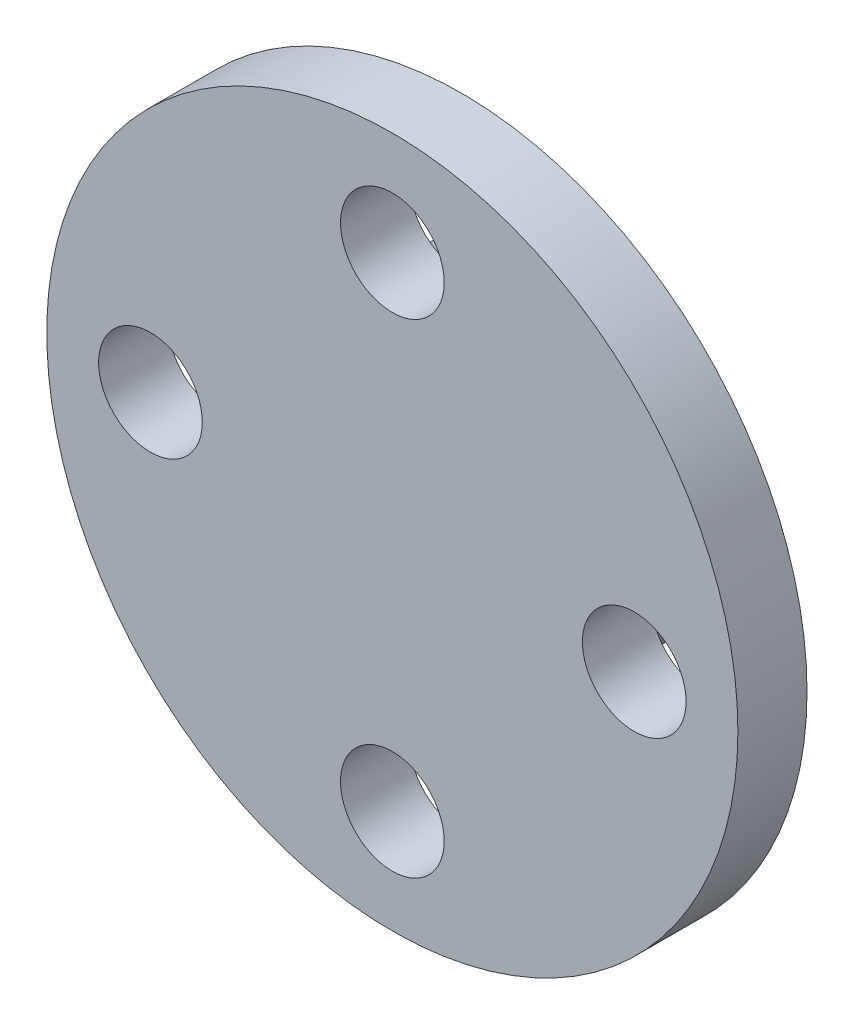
ISO-10303-21;
HEADER;
FILE_DESCRIPTION(('STEP AP214'),'2;1');
FILE_NAME('part.step','',(''),(''),'','','');
FILE_SCHEMA(('AUTOMOTIVE_DESIGN { 1 0 10303 214 1 1 1 1 }'));
ENDSEC;
DATA;
#1=APPLICATION_CONTEXT('core data for automotive mechanical design processes');
#2=APPLICATION_PROTOCOL_DEFINITION('international standard','automotive_design',2000,#1);
#3=PRODUCT_CONTEXT('',#1,'mechanical');
#4=PRODUCT('Part','Part','',(#3));
#5=PRODUCT_RELATED_PRODUCT_CATEGORY('part','',(#4));
#6=PRODUCT_DEFINITION_FORMATION('','',#4);
#7=PRODUCT_DEFINITION_CONTEXT('part definition',#1,'design');
#8=PRODUCT_DEFINITION('design','',#6,#7);
#9=PRODUCT_DEFINITION_SHAPE('','',#8);
#10=(LENGTH_UNIT() NAMED_UNIT(*) SI_UNIT(.MILLI.,.METRE.));
#11=(NAMED_UNIT(*) PLANE_ANGLE_UNIT() SI_UNIT($,.RADIAN.));
#12=(NAMED_UNIT(*) SI_UNIT($,.STERADIAN.) SOLID_ANGLE_UNIT());
#13=UNCERTAINTY_MEASURE_WITH_UNIT(LENGTH_MEASURE(1.E-05),#10,'distance_accuracy_value','');
#14=(GEOMETRIC_REPRESENTATION_CONTEXT(3) GLOBAL_UNCERTAINTY_ASSIGNED_CONTEXT((#13)) GLOBAL_UNIT_ASSIGNED_CONTEXT((#10,
#11,#12)) REPRESENTATION_CONTEXT('',''));
#15=CARTESIAN_POINT('',(0.,0.,0.));
#16=DIRECTION('',(0.,0.,1.));
#17=DIRECTION('',(1.,0.,0.));
#18=AXIS2_PLACEMENT_3D('',#15,#16,#17);
#19=CARTESIAN_POINT('',(0.,0.,3.6));
#20=DIRECTION('',(0.,0.,-1.));
#21=DIRECTION('',(-1.,0.,0.));
#22=AXIS2_PLACEMENT_3D('',#19,#20,#21);
#23=CYLINDRICAL_SURFACE('',#22,4.75);
#24=CARTESIAN_POINT('',(0.,0.,3.6));
#25=DIRECTION('',(0.,0.,1.));
#26=DIRECTION('',(1.,0.,0.));
#27=AXIS2_PLACEMENT_3D('',#24,#25,#26);
#28=CIRCLE('',#27,4.75);
#29=CARTESIAN_POINT('',(4.75,0.,3.6));
#30=VERTEX_POINT('',#29);
#31=EDGE_CURVE('E10',#30,#30,#28,.T.);
#32=ORIENTED_EDGE('',*,*,#31,.F.);
#33=EDGE_LOOP('',(#32));
#34=FACE_BOUND('',#33,.T.);
#35=CARTESIAN_POINT('',(0.,0.,0.));
#36=DIRECTION('',(0.,0.,1.));
#37=DIRECTION('',(1.,0.,0.));
#38=AXIS2_PLACEMENT_3D('',#35,#36,#37);
#39=CIRCLE('',#38,4.75);
#40=CARTESIAN_POINT('',(4.75,0.,0.));
#41=VERTEX_POINT('',#40);
#42=EDGE_CURVE('E36',#41,#41,#39,.T.);
#43=ORIENTED_EDGE('',*,*,#42,.T.);
#44=EDGE_LOOP('',(#43));
#45=FACE_BOUND('',#44,.T.);
#46=ADVANCED_FACE('F33',(#34,#45),#23,.T.);
#47=CARTESIAN_POINT('',(0.,0.,0.));
#48=DIRECTION('',(0.,0.,1.));
#49=DIRECTION('',(1.,0.,0.));
#50=AXIS2_PLACEMENT_3D('',#47,#48,#49);
#51=PLANE('',#50);
#52=ORIENTED_EDGE('',*,*,#42,.F.);
#53=EDGE_LOOP('',(#52));
#54=FACE_BOUND('',#53,.T.);
#55=ADVANCED_FACE('F100',(#54),#51,.F.);
#56=CARTESIAN_POINT('',(0.,0.,3.6));
#57=DIRECTION('',(0.,0.,1.));
#58=DIRECTION('',(1.,0.,0.));
#59=AXIS2_PLACEMENT_3D('',#56,#57,#58);
#60=PLANE('',#59);
#61=CARTESIAN_POINT('',(0.,0.,3.6));
#62=DIRECTION('',(0.,0.,1.));
#63=DIRECTION('',(1.,0.,0.));
#64=AXIS2_PLACEMENT_3D('',#61,#62,#63);
#65=CIRCLE('',#64,10.);
#66=CARTESIAN_POINT('',(10.,0.,3.6));
#67=VERTEX_POINT('',#66);
#68=EDGE_CURVE('E45',#67,#67,#65,.T.);
#69=ORIENTED_EDGE('',*,*,#68,.F.);
#70=EDGE_LOOP('',(#69));
#71=FACE_BOUND('',#70,.T.);
#72=CARTESIAN_POINT('',(7.0000000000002,1.98094713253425E-13,3.6));
#73=DIRECTION('',(0.,0.,1.));
#74=DIRECTION('',(1.,0.,0.));
#75=AXIS2_PLACEMENT_3D('',#72,#73,#74);
#76=CIRCLE('',#75,1.50000000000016);
#77=CARTESIAN_POINT('',(8.50000000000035,1.98094713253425E-13,3.6));
#78=VERTEX_POINT('',#77);
#79=EDGE_CURVE('E49',#78,#78,#76,.T.);
#80=ORIENTED_EDGE('',*,*,#79,.T.);
#81=EDGE_LOOP('',(#80));
#82=FACE_BOUND('',#81,.T.);
#83=CARTESIAN_POINT('',(3.9618942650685E-13,-7.,3.6));
#84=DIRECTION('',(0.,0.,1.));
#85=DIRECTION('',(1.,0.,0.));
#86=AXIS2_PLACEMENT_3D('',#83,#84,#85);
#87=CIRCLE('',#86,1.50000000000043);
#88=CARTESIAN_POINT('',(1.50000000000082,-7.,3.6));
#89=VERTEX_POINT('',#88);
#90=EDGE_CURVE('E52',#89,#89,#87,.T.);
#91=ORIENTED_EDGE('',*,*,#90,.T.);
#92=EDGE_LOOP('',(#91));
#93=FACE_BOUND('',#92,.T.);
#94=CARTESIAN_POINT('',(-6.9999999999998,-1.98951966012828E-13,3.6));
#95=DIRECTION('',(0.,0.,1.));
#96=DIRECTION('',(1.,0.,0.));
#97=AXIS2_PLACEMENT_3D('',#94,#95,#96);
#98=CIRCLE('',#97,1.50000000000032);
#99=CARTESIAN_POINT('',(-5.49999999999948,-1.98951966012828E-13,3.6));
#100=VERTEX_POINT('',#99);
#101=EDGE_CURVE('E55',#100,#100,#98,.T.);
#102=ORIENTED_EDGE('',*,*,#101,.T.);
#103=EDGE_LOOP('',(#102));
#104=FACE_BOUND('',#103,.T.);
#105=CARTESIAN_POINT('',(0.,7.,3.6));
#106=DIRECTION('',(0.,0.,1.));
#107=DIRECTION('',(1.,0.,0.));
#108=AXIS2_PLACEMENT_3D('',#105,#106,#107);
#109=CIRCLE('',#108,1.5);
#110=CARTESIAN_POINT('',(1.5,7.,3.6));
#111=VERTEX_POINT('',#110);
#112=EDGE_CURVE('E58',#111,#111,#109,.T.);
#113=ORIENTED_EDGE('',*,*,#112,.T.);
#114=EDGE_LOOP('',(#113));
#115=FACE_BOUND('',#114,.T.);
#116=ORIENTED_EDGE('',*,*,#31,.T.);
#117=EDGE_LOOP('',(#116));
#118=FACE_BOUND('',#117,.T.);
#119=ADVANCED_FACE('F96',(#71,#82,#93,#104,#115,#118),#60,.F.);
#120=CARTESIAN_POINT('',(7.0000000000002,1.98094713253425E-13,5.6));
#121=DIRECTION('',(0.,0.,-1.));
#122=DIRECTION('',(-1.,0.,0.));
#123=AXIS2_PLACEMENT_3D('',#120,#121,#122);
#124=CYLINDRICAL_SURFACE('',#123,1.50000000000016);
#125=CARTESIAN_POINT('',(7.0000000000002,1.98094713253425E-13,5.6));
#126=DIRECTION('',(0.,0.,1.));
#127=DIRECTION('',(1.,0.,0.));
#128=AXIS2_PLACEMENT_3D('',#125,#126,#127);
#129=CIRCLE('',#128,1.50000000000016);
#130=CARTESIAN_POINT('',(8.50000000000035,1.98094713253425E-13,5.6));
#131=VERTEX_POINT('',#130);
#132=EDGE_CURVE('E63',#131,#131,#129,.T.);
#133=ORIENTED_EDGE('',*,*,#132,.T.);
#134=EDGE_LOOP('',(#133));
#135=FACE_BOUND('',#134,.T.);
#136=ORIENTED_EDGE('',*,*,#79,.F.);
#137=EDGE_LOOP('',(#136));
#138=FACE_BOUND('',#137,.T.);
#139=ADVANCED_FACE('F99',(#135,#138),#124,.F.);
#140=CARTESIAN_POINT('',(3.9618942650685E-13,-7.,5.6));
#141=DIRECTION('',(0.,0.,-1.));
#142=DIRECTION('',(-1.,0.,0.));
#143=AXIS2_PLACEMENT_3D('',#140,#141,#142);
#144=CYLINDRICAL_SURFACE('',#143,1.50000000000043);
#145=CARTESIAN_POINT('',(3.9618942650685E-13,-7.,5.6));
#146=DIRECTION('',(0.,0.,1.));
#147=DIRECTION('',(1.,0.,0.));
#148=AXIS2_PLACEMENT_3D('',#145,#146,#147);
#149=CIRCLE('',#148,1.50000000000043);
#150=CARTESIAN_POINT('',(1.50000000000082,-7.,5.6));
#151=VERTEX_POINT('',#150);
#152=EDGE_CURVE('E66',#151,#151,#149,.T.);
#153=ORIENTED_EDGE('',*,*,#152,.T.);
#154=EDGE_LOOP('',(#153));
#155=FACE_BOUND('',#154,.T.);
#156=ORIENTED_EDGE('',*,*,#90,.F.);
#157=EDGE_LOOP('',(#156));
#158=FACE_BOUND('',#157,.T.);
#159=ADVANCED_FACE('F115',(#155,#158),#144,.F.);
#160=CARTESIAN_POINT('',(-6.9999999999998,-1.98951966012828E-13,5.6));
#161=DIRECTION('',(0.,0.,-1.));
#162=DIRECTION('',(-1.,0.,0.));
#163=AXIS2_PLACEMENT_3D('',#160,#161,#162);
#164=CYLINDRICAL_SURFACE('',#163,1.50000000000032);
#165=CARTESIAN_POINT('',(-6.9999999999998,-1.98951966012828E-13,5.6));
#166=DIRECTION('',(0.,0.,1.));
#167=DIRECTION('',(1.,0.,0.));
#168=AXIS2_PLACEMENT_3D('',#165,#166,#167);
#169=CIRCLE('',#168,1.50000000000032);
#170=CARTESIAN_POINT('',(-5.49999999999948,-1.98951966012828E-13,5.6));
#171=VERTEX_POINT('',#170);
#172=EDGE_CURVE('E69',#171,#171,#169,.T.);
#173=ORIENTED_EDGE('',*,*,#172,.T.);
#174=EDGE_LOOP('',(#173));
#175=FACE_BOUND('',#174,.T.);
#176=ORIENTED_EDGE('',*,*,#101,.F.);
#177=EDGE_LOOP('',(#176));
#178=FACE_BOUND('',#177,.T.);
#179=ADVANCED_FACE('F110',(#175,#178),#164,.F.);
#180=CARTESIAN_POINT('',(0.,7.,5.6));
#181=DIRECTION('',(0.,0.,-1.));
#182=DIRECTION('',(-1.,0.,0.));
#183=AXIS2_PLACEMENT_3D('',#180,#181,#182);
#184=CYLINDRICAL_SURFACE('',#183,1.5);
#185=CARTESIAN_POINT('',(0.,7.,5.6));
#186=DIRECTION('',(0.,0.,1.));
#187=DIRECTION('',(1.,0.,0.));
#188=AXIS2_PLACEMENT_3D('',#185,#186,#187);
#189=CIRCLE('',#188,1.5);
#190=CARTESIAN_POINT('',(1.5,7.,5.6));
#191=VERTEX_POINT('',#190);
#192=EDGE_CURVE('E48',#191,#191,#189,.T.);
#193=ORIENTED_EDGE('',*,*,#192,.T.);
#194=EDGE_LOOP('',(#193));
#195=FACE_BOUND('',#194,.T.);
#196=ORIENTED_EDGE('',*,*,#112,.F.);
#197=EDGE_LOOP('',(#196));
#198=FACE_BOUND('',#197,.T.);
#199=ADVANCED_FACE('F75',(#195,#198),#184,.F.);
#200=CARTESIAN_POINT('',(0.,0.,5.6));
#201=DIRECTION('',(0.,0.,-1.));
#202=DIRECTION('',(-1.,0.,0.));
#203=AXIS2_PLACEMENT_3D('',#200,#201,#202);
#204=CYLINDRICAL_SURFACE('',#203,10.);
#205=CARTESIAN_POINT('',(0.,0.,5.6));
#206=DIRECTION('',(0.,0.,1.));
#207=DIRECTION('',(1.,0.,0.));
#208=AXIS2_PLACEMENT_3D('',#205,#206,#207);
#209=CIRCLE('',#208,10.);
#210=CARTESIAN_POINT('',(10.,0.,5.6));
#211=VERTEX_POINT('',#210);
#212=EDGE_CURVE('E43',#211,#211,#209,.T.);
#213=ORIENTED_EDGE('',*,*,#212,.F.);
#214=EDGE_LOOP('',(#213));
#215=FACE_BOUND('',#214,.T.);
#216=ORIENTED_EDGE('',*,*,#68,.T.);
#217=EDGE_LOOP('',(#216));
#218=FACE_BOUND('',#217,.T.);
#219=ADVANCED_FACE('F81',(#215,#218),#204,.T.);
#220=CARTESIAN_POINT('',(0.,0.,5.6));
#221=DIRECTION('',(0.,0.,1.));
#222=DIRECTION('',(1.,0.,0.));
#223=AXIS2_PLACEMENT_3D('',#220,#221,#222);
#224=PLANE('',#223);
#225=ORIENTED_EDGE('',*,*,#192,.F.);
#226=EDGE_LOOP('',(#225));
#227=FACE_BOUND('',#226,.T.);
#228=ORIENTED_EDGE('',*,*,#172,.F.);
#229=EDGE_LOOP('',(#228));
#230=FACE_BOUND('',#229,.T.);
#231=ORIENTED_EDGE('',*,*,#152,.F.);
#232=EDGE_LOOP('',(#231));
#233=FACE_BOUND('',#232,.T.);
#234=ORIENTED_EDGE('',*,*,#132,.F.);
#235=EDGE_LOOP('',(#234));
#236=FACE_BOUND('',#235,.T.);
#237=ORIENTED_EDGE('',*,*,#212,.T.);
#238=EDGE_LOOP('',(#237));
#239=FACE_BOUND('',#238,.T.);
#240=ADVANCED_FACE('F78',(#227,#230,#233,#236,#239),#224,.T.);
#241=CLOSED_SHELL('',(#46,#55,#119,#139,#159,#179,#199,#219,#240));
#242=MANIFOLD_SOLID_BREP('B2',#241);
#243=ADVANCED_BREP_SHAPE_REPRESENTATION('',(#18,#242),#14);
#244=SHAPE_DEFINITION_REPRESENTATION(#9,#243);
ENDSEC;
END-ISO-10303-21;
